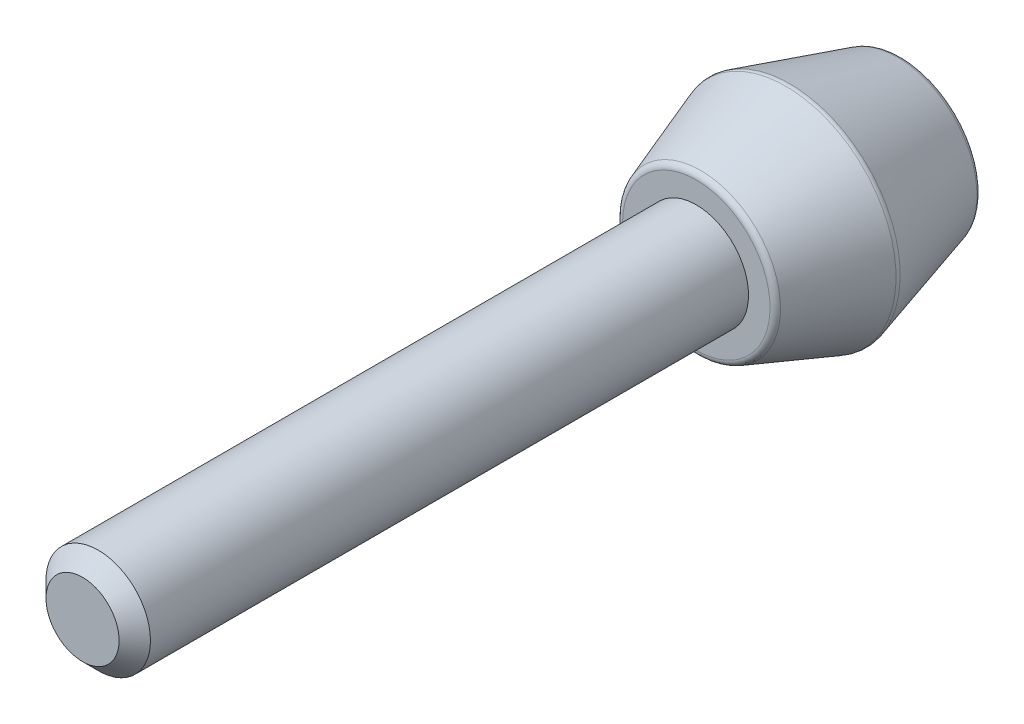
ISO-10303-21;
HEADER;
FILE_DESCRIPTION(('STEP AP214'),'2;1');
FILE_NAME('part.step','',(''),(''),'','','');
FILE_SCHEMA(('AUTOMOTIVE_DESIGN { 1 0 10303 214 1 1 1 1 }'));
ENDSEC;
DATA;
#1=APPLICATION_CONTEXT('core data for automotive mechanical design processes');
#2=APPLICATION_PROTOCOL_DEFINITION('international standard','automotive_design',2000,#1);
#3=PRODUCT_CONTEXT('',#1,'mechanical');
#4=PRODUCT('Part','Part','',(#3));
#5=PRODUCT_RELATED_PRODUCT_CATEGORY('part','',(#4));
#6=PRODUCT_DEFINITION_FORMATION('','',#4);
#7=PRODUCT_DEFINITION_CONTEXT('part definition',#1,'design');
#8=PRODUCT_DEFINITION('design','',#6,#7);
#9=PRODUCT_DEFINITION_SHAPE('','',#8);
#10=(LENGTH_UNIT() NAMED_UNIT(*) SI_UNIT(.MILLI.,.METRE.));
#11=(NAMED_UNIT(*) PLANE_ANGLE_UNIT() SI_UNIT($,.RADIAN.));
#12=(NAMED_UNIT(*) SI_UNIT($,.STERADIAN.) SOLID_ANGLE_UNIT());
#13=UNCERTAINTY_MEASURE_WITH_UNIT(LENGTH_MEASURE(1.E-05),#10,'distance_accuracy_value','');
#14=(GEOMETRIC_REPRESENTATION_CONTEXT(3) GLOBAL_UNCERTAINTY_ASSIGNED_CONTEXT((#13)) GLOBAL_UNIT_ASSIGNED_CONTEXT((#10,
#11,#12)) REPRESENTATION_CONTEXT('',''));
#15=CARTESIAN_POINT('',(0.,0.,0.));
#16=DIRECTION('',(0.,0.,1.));
#17=DIRECTION('',(1.,0.,0.));
#18=AXIS2_PLACEMENT_3D('',#15,#16,#17);
#19=CARTESIAN_POINT('',(0.,0.,15.25));
#20=DIRECTION('',(0.,0.,-1.));
#21=DIRECTION('',(0.379653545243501,0.925128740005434,0.));
#22=AXIS2_PLACEMENT_3D('',#19,#20,#21);
#23=TOROIDAL_SURFACE('',#22,5.64764040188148,0.5);
#24=CARTESIAN_POINT('',(0.,0.,15.4181681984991));
#25=DIRECTION('',(0.,0.,-1.));
#26=DIRECTION('',(0.379653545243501,0.925128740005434,0.));
#27=AXIS2_PLACEMENT_3D('',#24,#25,#26);
#28=CIRCLE('',#27,6.1185113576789);
#29=CARTESIAN_POINT('',(2.32291452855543,5.66041070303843,15.4181681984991));
#30=VERTEX_POINT('',#29);
#31=EDGE_CURVE('E37',#30,#30,#28,.T.);
#32=ORIENTED_EDGE('',*,*,#31,.F.);
#33=EDGE_LOOP('',(#32));
#34=FACE_BOUND('',#33,.T.);
#35=CARTESIAN_POINT('',(0.,0.,15.75));
#36=DIRECTION('',(0.,0.,1.));
#37=DIRECTION('',(0.379653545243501,0.925128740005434,0.));
#38=AXIS2_PLACEMENT_3D('',#35,#36,#37);
#39=CIRCLE('',#38,5.64764040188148);
#40=CARTESIAN_POINT('',(2.14414670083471,5.22479444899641,15.75));
#41=VERTEX_POINT('',#40);
#42=EDGE_CURVE('E29',#41,#41,#39,.T.);
#43=ORIENTED_EDGE('',*,*,#42,.F.);
#44=EDGE_LOOP('',(#43));
#45=FACE_BOUND('',#44,.T.);
#46=ADVANCED_FACE('F12',(#34,#45),#23,.T.);
#47=CARTESIAN_POINT('',(0.,0.,8.73300839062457));
#48=DIRECTION('',(0.,0.,-1.));
#49=DIRECTION('',(0.379653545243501,0.925128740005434,0.));
#50=AXIS2_PLACEMENT_3D('',#47,#48,#49);
#51=TOROIDAL_SURFACE('',#50,7.97513740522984,0.5);
#52=CARTESIAN_POINT('',(0.,0.,8.5956478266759));
#53=DIRECTION('',(0.,0.,-1.));
#54=DIRECTION('',(0.379653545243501,0.925128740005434,0.));
#55=AXIS2_PLACEMENT_3D('',#52,#53,#54);
#56=CIRCLE('',#55,8.45589937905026);
#57=CARTESIAN_POINT('',(3.21031217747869,7.82279553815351,8.5956478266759));
#58=VERTEX_POINT('',#57);
#59=EDGE_CURVE('E16',#58,#58,#56,.T.);
#60=ORIENTED_EDGE('',*,*,#59,.F.);
#61=EDGE_LOOP('',(#60));
#62=FACE_BOUND('',#61,.T.);
#63=CARTESIAN_POINT('',(0.,0.,8.90117658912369));
#64=DIRECTION('',(0.,0.,1.));
#65=DIRECTION('',(-0.379653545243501,-0.925128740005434,0.));
#66=AXIS2_PLACEMENT_3D('',#63,#64,#65);
#67=CIRCLE('',#66,8.44600836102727);
#68=CARTESIAN_POINT('',(-3.2065570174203,-7.81364507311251,8.90117658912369));
#69=VERTEX_POINT('',#68);
#70=EDGE_CURVE('E41',#69,#69,#67,.T.);
#71=ORIENTED_EDGE('',*,*,#70,.F.);
#72=EDGE_LOOP('',(#71));
#73=FACE_BOUND('',#72,.T.);
#74=ADVANCED_FACE('F14',(#62,#73),#51,.T.);
#75=CARTESIAN_POINT('',(0.,0.,0.5));
#76=DIRECTION('',(0.,0.,-1.));
#77=DIRECTION('',(0.379653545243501,0.925128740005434,0.));
#78=AXIS2_PLACEMENT_3D('',#75,#76,#77);
#79=TOROIDAL_SURFACE('',#78,5.62284929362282,0.5);
#80=CARTESIAN_POINT('',(0.,0.,0.));
#81=DIRECTION('',(0.,0.,-1.));
#82=DIRECTION('',(0.379653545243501,0.925128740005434,0.));
#83=AXIS2_PLACEMENT_3D('',#80,#81,#82);
#84=CIRCLE('',#83,5.62284929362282);
#85=CARTESIAN_POINT('',(2.13473466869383,5.20185948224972,0.));
#86=VERTEX_POINT('',#85);
#87=EDGE_CURVE('E33',#86,#86,#84,.T.);
#88=ORIENTED_EDGE('',*,*,#87,.F.);
#89=EDGE_LOOP('',(#88));
#90=FACE_BOUND('',#89,.T.);
#91=CARTESIAN_POINT('',(0.,0.,0.362639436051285));
#92=DIRECTION('',(0.,0.,1.));
#93=DIRECTION('',(0.379653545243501,0.925128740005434,0.));
#94=AXIS2_PLACEMENT_3D('',#91,#92,#93);
#95=CIRCLE('',#94,6.10361126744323);
#96=CARTESIAN_POINT('',(2.31725765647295,5.64662620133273,0.362639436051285));
#97=VERTEX_POINT('',#96);
#98=EDGE_CURVE('E42',#97,#97,#95,.T.);
#99=ORIENTED_EDGE('',*,*,#98,.F.);
#100=EDGE_LOOP('',(#99));
#101=FACE_BOUND('',#100,.T.);
#102=ADVANCED_FACE('F55',(#90,#101),#79,.T.);
#103=CARTESIAN_POINT('',(0.,0.,15.75));
#104=DIRECTION('',(0.,0.,-1.));
#105=DIRECTION('',(0.379653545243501,0.925128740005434,0.));
#106=AXIS2_PLACEMENT_3D('',#103,#104,#105);
#107=CONICAL_SURFACE('',#106,6.,0.343023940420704);
#108=ORIENTED_EDGE('',*,*,#70,.T.);
#109=EDGE_LOOP('',(#108));
#110=FACE_BOUND('',#109,.T.);
#111=ORIENTED_EDGE('',*,*,#31,.T.);
#112=EDGE_LOOP('',(#111));
#113=FACE_BOUND('',#112,.T.);
#114=ADVANCED_FACE('F51',(#110,#113),#107,.T.);
#115=CARTESIAN_POINT('',(0.,0.,0.));
#116=DIRECTION('',(0.,0.,1.));
#117=DIRECTION('',(-0.379653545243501,-0.925128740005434,0.));
#118=AXIS2_PLACEMENT_3D('',#115,#116,#117);
#119=CONICAL_SURFACE('',#118,6.,0.278299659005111);
#120=ORIENTED_EDGE('',*,*,#59,.T.);
#121=EDGE_LOOP('',(#120));
#122=FACE_BOUND('',#121,.T.);
#123=ORIENTED_EDGE('',*,*,#98,.T.);
#124=EDGE_LOOP('',(#123));
#125=FACE_BOUND('',#124,.T.);
#126=ADVANCED_FACE('F87',(#122,#125),#119,.T.);
#127=CARTESIAN_POINT('',(0.,0.,0.));
#128=DIRECTION('',(0.,0.,-1.));
#129=DIRECTION('',(0.379653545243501,0.925128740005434,0.));
#130=AXIS2_PLACEMENT_3D('',#127,#128,#129);
#131=PLANE('',#130);
#132=ORIENTED_EDGE('',*,*,#87,.T.);
#133=EDGE_LOOP('',(#132));
#134=FACE_BOUND('',#133,.T.);
#135=ADVANCED_FACE('F82',(#134),#131,.T.);
#136=CARTESIAN_POINT('',(0.,0.,15.75));
#137=DIRECTION('',(0.,0.,-1.));
#138=DIRECTION('',(0.379653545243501,0.925128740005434,0.));
#139=AXIS2_PLACEMENT_3D('',#136,#137,#138);
#140=PLANE('',#139);
#141=CARTESIAN_POINT('',(0.,0.,15.75));
#142=DIRECTION('',(0.,0.,-1.));
#143=DIRECTION('',(1.,0.,0.));
#144=AXIS2_PLACEMENT_3D('',#141,#142,#143);
#145=CIRCLE('',#144,4.);
#146=CARTESIAN_POINT('',(3.99999999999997,0.,15.75));
#147=VERTEX_POINT('',#146);
#148=EDGE_CURVE('E8',#147,#147,#145,.F.);
#149=ORIENTED_EDGE('',*,*,#148,.F.);
#150=EDGE_LOOP('',(#149));
#151=FACE_BOUND('',#150,.T.);
#152=ORIENTED_EDGE('',*,*,#42,.T.);
#153=EDGE_LOOP('',(#152));
#154=FACE_BOUND('',#153,.T.);
#155=ADVANCED_FACE('F72',(#151,#154),#140,.F.);
#156=CARTESIAN_POINT('',(0.,0.,62.75));
#157=DIRECTION('',(0.,0.,-1.));
#158=DIRECTION('',(0.481271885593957,0.876571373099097,0.));
#159=AXIS2_PLACEMENT_3D('',#156,#157,#158);
#160=PLANE('',#159);
#161=CARTESIAN_POINT('',(0.,0.,62.75));
#162=DIRECTION('',(0.,0.,-1.));
#163=DIRECTION('',(0.481271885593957,0.876571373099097,0.));
#164=AXIS2_PLACEMENT_3D('',#161,#162,#163);
#165=CIRCLE('',#164,2.8);
#166=CARTESIAN_POINT('',(1.34756127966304,2.45439984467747,62.75));
#167=VERTEX_POINT('',#166);
#168=EDGE_CURVE('E20',#167,#167,#165,.F.);
#169=ORIENTED_EDGE('',*,*,#168,.T.);
#170=EDGE_LOOP('',(#169));
#171=FACE_BOUND('',#170,.T.);
#172=ADVANCED_FACE('F69',(#171),#160,.F.);
#173=CARTESIAN_POINT('',(0.,0.,61.55));
#174=DIRECTION('',(0.,0.,-1.));
#175=DIRECTION('',(0.481271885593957,0.876571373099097,0.));
#176=AXIS2_PLACEMENT_3D('',#173,#174,#175);
#177=CONICAL_SURFACE('',#176,4.,0.78539816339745);
#178=ORIENTED_EDGE('',*,*,#168,.F.);
#179=EDGE_LOOP('',(#178));
#180=FACE_BOUND('',#179,.T.);
#181=CARTESIAN_POINT('',(0.,0.,61.55));
#182=DIRECTION('',(0.,0.,-1.));
#183=DIRECTION('',(0.481271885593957,0.876571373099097,0.));
#184=AXIS2_PLACEMENT_3D('',#181,#182,#183);
#185=CIRCLE('',#184,4.);
#186=CARTESIAN_POINT('',(1.92508754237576,3.50628549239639,61.55));
#187=VERTEX_POINT('',#186);
#188=EDGE_CURVE('E25',#187,#187,#185,.T.);
#189=ORIENTED_EDGE('',*,*,#188,.F.);
#190=EDGE_LOOP('',(#189));
#191=FACE_BOUND('',#190,.T.);
#192=ADVANCED_FACE('F71',(#180,#191),#177,.T.);
#193=CARTESIAN_POINT('',(0.,0.,2.75));
#194=DIRECTION('',(0.,0.,1.));
#195=DIRECTION('',(-0.481271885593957,-0.876571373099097,0.));
#196=AXIS2_PLACEMENT_3D('',#193,#194,#195);
#197=CYLINDRICAL_SURFACE('',#196,4.);
#198=ORIENTED_EDGE('',*,*,#188,.T.);
#199=EDGE_LOOP('',(#198));
#200=FACE_BOUND('',#199,.T.);
#201=ORIENTED_EDGE('',*,*,#148,.T.);
#202=EDGE_LOOP('',(#201));
#203=FACE_BOUND('',#202,.T.);
#204=ADVANCED_FACE('F67',(#200,#203),#197,.T.);
#205=CLOSED_SHELL('',(#46,#74,#102,#114,#126,#135,#155,#172,#192,#204));
#206=MANIFOLD_SOLID_BREP('B1',#205);
#207=ADVANCED_BREP_SHAPE_REPRESENTATION('',(#18,#206),#14);
#208=SHAPE_DEFINITION_REPRESENTATION(#9,#207);
ENDSEC;
END-ISO-10303-21;
